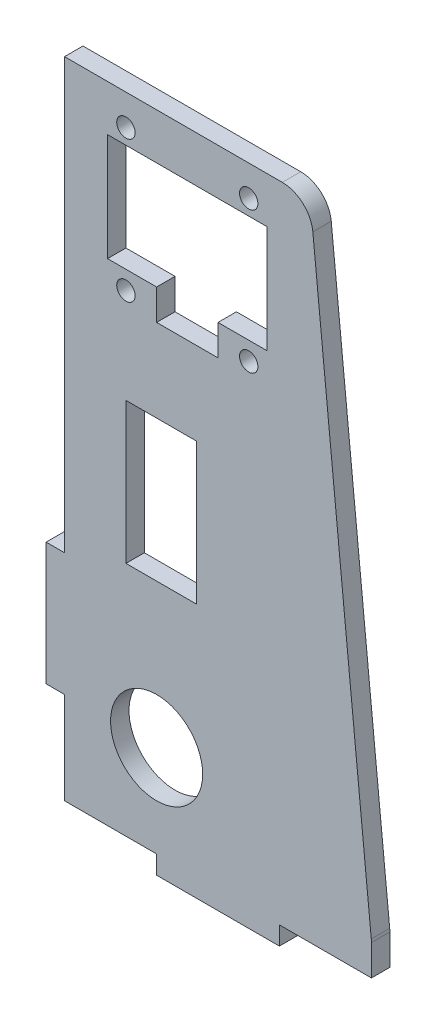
ISO-10303-21;
HEADER;
FILE_DESCRIPTION(('STEP AP214'),'2;1');
FILE_NAME('part.step','',(''),(''),'','','');
FILE_SCHEMA(('AUTOMOTIVE_DESIGN { 1 0 10303 214 1 1 1 1 }'));
ENDSEC;
DATA;
#1=APPLICATION_CONTEXT('core data for automotive mechanical design processes');
#2=APPLICATION_PROTOCOL_DEFINITION('international standard','automotive_design',2000,#1);
#3=PRODUCT_CONTEXT('',#1,'mechanical');
#4=PRODUCT('Part','Part','',(#3));
#5=PRODUCT_RELATED_PRODUCT_CATEGORY('part','',(#4));
#6=PRODUCT_DEFINITION_FORMATION('','',#4);
#7=PRODUCT_DEFINITION_CONTEXT('part definition',#1,'design');
#8=PRODUCT_DEFINITION('design','',#6,#7);
#9=PRODUCT_DEFINITION_SHAPE('','',#8);
#10=(LENGTH_UNIT() NAMED_UNIT(*) SI_UNIT(.MILLI.,.METRE.));
#11=(NAMED_UNIT(*) PLANE_ANGLE_UNIT() SI_UNIT($,.RADIAN.));
#12=(NAMED_UNIT(*) SI_UNIT($,.STERADIAN.) SOLID_ANGLE_UNIT());
#13=UNCERTAINTY_MEASURE_WITH_UNIT(LENGTH_MEASURE(1.E-05),#10,'distance_accuracy_value','');
#14=(GEOMETRIC_REPRESENTATION_CONTEXT(3) GLOBAL_UNCERTAINTY_ASSIGNED_CONTEXT((#13)) GLOBAL_UNIT_ASSIGNED_CONTEXT((#10,
#11,#12)) REPRESENTATION_CONTEXT('',''));
#15=CARTESIAN_POINT('',(0.,0.,0.));
#16=DIRECTION('',(0.,0.,1.));
#17=DIRECTION('',(1.,0.,0.));
#18=AXIS2_PLACEMENT_3D('',#15,#16,#17);
#19=CARTESIAN_POINT('',(35.4761904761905,100.,3.));
#20=DIRECTION('',(0.,0.,-1.));
#21=DIRECTION('',(-1.,0.,0.));
#22=AXIS2_PLACEMENT_3D('',#19,#20,#21);
#23=PLANE('',#22);
#24=DIRECTION('',(0.,-1.,0.));
#25=VECTOR('',#24,1.);
#26=CARTESIAN_POINT('',(10.,61.5,3.));
#27=LINE('',#26,#25);
#28=CARTESIAN_POINT('',(10.,61.5,3.));
#29=VERTEX_POINT('',#28);
#30=CARTESIAN_POINT('',(10.,38.5,3.));
#31=VERTEX_POINT('',#30);
#32=EDGE_CURVE('E280',#29,#31,#27,.T.);
#33=ORIENTED_EDGE('',*,*,#32,.F.);
#34=DIRECTION('',(-1.,0.,0.));
#35=VECTOR('',#34,1.);
#36=CARTESIAN_POINT('',(10.,61.5,3.));
#37=LINE('',#36,#35);
#38=CARTESIAN_POINT('',(21.5,61.5,3.));
#39=VERTEX_POINT('',#38);
#40=EDGE_CURVE('E288',#39,#29,#37,.T.);
#41=ORIENTED_EDGE('',*,*,#40,.F.);
#42=DIRECTION('',(0.,1.,0.));
#43=VECTOR('',#42,1.);
#44=CARTESIAN_POINT('',(21.5,61.5,3.));
#45=LINE('',#44,#43);
#46=CARTESIAN_POINT('',(21.5,38.5,3.));
#47=VERTEX_POINT('',#46);
#48=EDGE_CURVE('E285',#47,#39,#45,.T.);
#49=ORIENTED_EDGE('',*,*,#48,.F.);
#50=DIRECTION('',(1.,0.,0.));
#51=VECTOR('',#50,1.);
#52=CARTESIAN_POINT('',(10.,38.5,3.));
#53=LINE('',#52,#51);
#54=EDGE_CURVE('E282',#31,#47,#53,.T.);
#55=ORIENTED_EDGE('',*,*,#54,.F.);
#56=EDGE_LOOP('',(#33,#41,#49,#55));
#57=FACE_BOUND('',#56,.T.);
#58=DIRECTION('',(1.,0.,0.));
#59=VECTOR('',#58,1.);
#60=CARTESIAN_POINT('',(15.,0.,3.));
#61=LINE('',#60,#59);
#62=CARTESIAN_POINT('',(0.,0.,3.));
#63=VERTEX_POINT('',#62);
#64=CARTESIAN_POINT('',(15.,0.,3.));
#65=VERTEX_POINT('',#64);
#66=EDGE_CURVE('E311',#63,#65,#61,.T.);
#67=ORIENTED_EDGE('',*,*,#66,.T.);
#68=DIRECTION('',(0.,-1.,0.));
#69=VECTOR('',#68,1.);
#70=CARTESIAN_POINT('',(15.,0.,3.));
#71=LINE('',#70,#69);
#72=CARTESIAN_POINT('',(15.,-3.,3.));
#73=VERTEX_POINT('',#72);
#74=EDGE_CURVE('E314',#65,#73,#71,.T.);
#75=ORIENTED_EDGE('',*,*,#74,.T.);
#76=DIRECTION('',(1.,0.,0.));
#77=VECTOR('',#76,1.);
#78=CARTESIAN_POINT('',(15.,-3.,3.));
#79=LINE('',#78,#77);
#80=CARTESIAN_POINT('',(35.,-3.,3.));
#81=VERTEX_POINT('',#80);
#82=EDGE_CURVE('E317',#73,#81,#79,.T.);
#83=ORIENTED_EDGE('',*,*,#82,.T.);
#84=DIRECTION('',(0.,1.,0.));
#85=VECTOR('',#84,1.);
#86=CARTESIAN_POINT('',(35.,-3.,3.));
#87=LINE('',#86,#85);
#88=CARTESIAN_POINT('',(35.,0.,3.));
#89=VERTEX_POINT('',#88);
#90=EDGE_CURVE('E319',#81,#89,#87,.T.);
#91=ORIENTED_EDGE('',*,*,#90,.T.);
#92=DIRECTION('',(1.,0.,0.));
#93=VECTOR('',#92,1.);
#94=CARTESIAN_POINT('',(50.,0.,3.));
#95=LINE('',#94,#93);
#96=CARTESIAN_POINT('',(50.,0.,3.));
#97=VERTEX_POINT('',#96);
#98=EDGE_CURVE('E321',#89,#97,#95,.T.);
#99=ORIENTED_EDGE('',*,*,#98,.T.);
#100=DIRECTION('',(0.,1.,0.));
#101=VECTOR('',#100,1.);
#102=CARTESIAN_POINT('',(50.,5.,3.));
#103=LINE('',#102,#101);
#104=CARTESIAN_POINT('',(50.,5.,3.));
#105=VERTEX_POINT('',#104);
#106=EDGE_CURVE('E323',#97,#105,#103,.T.);
#107=ORIENTED_EDGE('',*,*,#106,.T.);
#108=CARTESIAN_POINT('',(45.,5.,3.));
#109=DIRECTION('',(0.,0.,1.));
#110=DIRECTION('',(-1.,0.,0.));
#111=AXIS2_PLACEMENT_3D('',#108,#109,#110);
#112=CIRCLE('',#111,5.);
#113=CARTESIAN_POINT('',(49.9750623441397,5.49875311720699,3.));
#114=VERTEX_POINT('',#113);
#115=EDGE_CURVE('E325',#105,#114,#112,.T.);
#116=ORIENTED_EDGE('',*,*,#115,.T.);
#117=DIRECTION('',(-0.0997506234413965,0.99501246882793,0.));
#118=VECTOR('',#117,1.);
#119=CARTESIAN_POINT('',(40.4512528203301,100.498753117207,3.));
#120=LINE('',#119,#118);
#121=CARTESIAN_POINT('',(40.4512528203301,100.498753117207,3.));
#122=VERTEX_POINT('',#121);
#123=EDGE_CURVE('E327',#114,#122,#120,.T.);
#124=ORIENTED_EDGE('',*,*,#123,.T.);
#125=CARTESIAN_POINT('',(35.4761904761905,100.,3.));
#126=DIRECTION('',(0.,0.,1.));
#127=DIRECTION('',(-1.,0.,0.));
#128=AXIS2_PLACEMENT_3D('',#125,#126,#127);
#129=CIRCLE('',#128,5.);
#130=CARTESIAN_POINT('',(35.4761904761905,105.,3.));
#131=VERTEX_POINT('',#130);
#132=EDGE_CURVE('E329',#122,#131,#129,.T.);
#133=ORIENTED_EDGE('',*,*,#132,.T.);
#134=DIRECTION('',(-1.,0.,0.));
#135=VECTOR('',#134,1.);
#136=CARTESIAN_POINT('',(0.,105.,3.));
#137=LINE('',#136,#135);
#138=CARTESIAN_POINT('',(0.,105.,3.));
#139=VERTEX_POINT('',#138);
#140=EDGE_CURVE('E331',#131,#139,#137,.T.);
#141=ORIENTED_EDGE('',*,*,#140,.T.);
#142=DIRECTION('',(0.,-1.,0.));
#143=VECTOR('',#142,1.);
#144=CARTESIAN_POINT('',(0.,35.,3.));
#145=LINE('',#144,#143);
#146=CARTESIAN_POINT('',(0.,35.,3.));
#147=VERTEX_POINT('',#146);
#148=EDGE_CURVE('E333',#139,#147,#145,.T.);
#149=ORIENTED_EDGE('',*,*,#148,.T.);
#150=DIRECTION('',(-1.,0.,0.));
#151=VECTOR('',#150,1.);
#152=CARTESIAN_POINT('',(-3.,35.,3.));
#153=LINE('',#152,#151);
#154=CARTESIAN_POINT('',(-3.,35.,3.));
#155=VERTEX_POINT('',#154);
#156=EDGE_CURVE('E335',#147,#155,#153,.T.);
#157=ORIENTED_EDGE('',*,*,#156,.T.);
#158=DIRECTION('',(0.,-1.,0.));
#159=VECTOR('',#158,1.);
#160=CARTESIAN_POINT('',(-3.,15.,3.));
#161=LINE('',#160,#159);
#162=CARTESIAN_POINT('',(-3.,15.,3.));
#163=VERTEX_POINT('',#162);
#164=EDGE_CURVE('E337',#155,#163,#161,.T.);
#165=ORIENTED_EDGE('',*,*,#164,.T.);
#166=DIRECTION('',(1.,0.,0.));
#167=VECTOR('',#166,1.);
#168=CARTESIAN_POINT('',(0.,15.,3.));
#169=LINE('',#168,#167);
#170=CARTESIAN_POINT('',(0.,15.,3.));
#171=VERTEX_POINT('',#170);
#172=EDGE_CURVE('E339',#163,#171,#169,.T.);
#173=ORIENTED_EDGE('',*,*,#172,.T.);
#174=DIRECTION('',(0.,-1.,0.));
#175=VECTOR('',#174,1.);
#176=CARTESIAN_POINT('',(0.,0.,3.));
#177=LINE('',#176,#175);
#178=EDGE_CURVE('E341',#171,#63,#177,.T.);
#179=ORIENTED_EDGE('',*,*,#178,.T.);
#180=EDGE_LOOP('',(#67,#75,#83,#91,#99,#107,#116,#124,#133,#141,#149,#157,#165,#173,#179));
#181=FACE_BOUND('',#180,.T.);
#182=DIRECTION('',(0.,-1.,0.));
#183=VECTOR('',#182,1.);
#184=CARTESIAN_POINT('',(7.,80.,3.));
#185=LINE('',#184,#183);
#186=CARTESIAN_POINT('',(7.,97.5,3.));
#187=VERTEX_POINT('',#186);
#188=CARTESIAN_POINT('',(7.,80.,3.));
#189=VERTEX_POINT('',#188);
#190=EDGE_CURVE('E212',#187,#189,#185,.T.);
#191=ORIENTED_EDGE('',*,*,#190,.F.);
#192=DIRECTION('',(-1.,0.,0.));
#193=VECTOR('',#192,1.);
#194=CARTESIAN_POINT('',(7.,97.5,3.));
#195=LINE('',#194,#193);
#196=CARTESIAN_POINT('',(33.,97.5,3.));
#197=VERTEX_POINT('',#196);
#198=EDGE_CURVE('E247',#197,#187,#195,.T.);
#199=ORIENTED_EDGE('',*,*,#198,.F.);
#200=DIRECTION('',(0.,1.,0.));
#201=VECTOR('',#200,1.);
#202=CARTESIAN_POINT('',(33.,97.5,3.));
#203=LINE('',#202,#201);
#204=CARTESIAN_POINT('',(33.,80.,3.));
#205=VERTEX_POINT('',#204);
#206=EDGE_CURVE('E245',#205,#197,#203,.T.);
#207=ORIENTED_EDGE('',*,*,#206,.F.);
#208=DIRECTION('',(1.,0.,0.));
#209=VECTOR('',#208,1.);
#210=CARTESIAN_POINT('',(33.,80.,3.));
#211=LINE('',#210,#209);
#212=CARTESIAN_POINT('',(25.,80.,3.));
#213=VERTEX_POINT('',#212);
#214=EDGE_CURVE('E243',#213,#205,#211,.T.);
#215=ORIENTED_EDGE('',*,*,#214,.F.);
#216=DIRECTION('',(0.,1.,0.));
#217=VECTOR('',#216,1.);
#218=CARTESIAN_POINT('',(25.,80.,3.));
#219=LINE('',#218,#217);
#220=CARTESIAN_POINT('',(25.,75.,3.));
#221=VERTEX_POINT('',#220);
#222=EDGE_CURVE('E241',#221,#213,#219,.T.);
#223=ORIENTED_EDGE('',*,*,#222,.F.);
#224=DIRECTION('',(1.,0.,0.));
#225=VECTOR('',#224,1.);
#226=CARTESIAN_POINT('',(25.,75.,3.));
#227=LINE('',#226,#225);
#228=CARTESIAN_POINT('',(15.,75.,3.));
#229=VERTEX_POINT('',#228);
#230=EDGE_CURVE('E236',#229,#221,#227,.T.);
#231=ORIENTED_EDGE('',*,*,#230,.F.);
#232=DIRECTION('',(0.,-1.,0.));
#233=VECTOR('',#232,1.);
#234=CARTESIAN_POINT('',(15.,75.,3.));
#235=LINE('',#234,#233);
#236=CARTESIAN_POINT('',(15.,80.,3.));
#237=VERTEX_POINT('',#236);
#238=EDGE_CURVE('E234',#237,#229,#235,.T.);
#239=ORIENTED_EDGE('',*,*,#238,.F.);
#240=DIRECTION('',(1.,0.,0.));
#241=VECTOR('',#240,1.);
#242=CARTESIAN_POINT('',(15.,80.,3.));
#243=LINE('',#242,#241);
#244=EDGE_CURVE('E220',#189,#237,#243,.T.);
#245=ORIENTED_EDGE('',*,*,#244,.F.);
#246=EDGE_LOOP('',(#191,#199,#207,#215,#223,#231,#239,#245));
#247=FACE_BOUND('',#246,.T.);
#248=CARTESIAN_POINT('',(10.,100.,3.));
#249=DIRECTION('',(0.,0.,1.));
#250=DIRECTION('',(1.,0.,0.));
#251=AXIS2_PLACEMENT_3D('',#248,#249,#250);
#252=CIRCLE('',#251,1.5);
#253=CARTESIAN_POINT('',(11.5,100.,3.));
#254=VERTEX_POINT('',#253);
#255=EDGE_CURVE('E250',#254,#254,#252,.T.);
#256=ORIENTED_EDGE('',*,*,#255,.F.);
#257=EDGE_LOOP('',(#256));
#258=FACE_BOUND('',#257,.T.);
#259=CARTESIAN_POINT('',(30.,100.,3.));
#260=DIRECTION('',(0.,0.,1.));
#261=DIRECTION('',(1.,0.,0.));
#262=AXIS2_PLACEMENT_3D('',#259,#260,#261);
#263=CIRCLE('',#262,1.5);
#264=CARTESIAN_POINT('',(31.5,100.,3.));
#265=VERTEX_POINT('',#264);
#266=EDGE_CURVE('E813',#265,#265,#263,.T.);
#267=ORIENTED_EDGE('',*,*,#266,.F.);
#268=EDGE_LOOP('',(#267));
#269=FACE_BOUND('',#268,.T.);
#270=CARTESIAN_POINT('',(10.,77.,3.));
#271=DIRECTION('',(0.,0.,1.));
#272=DIRECTION('',(1.,0.,0.));
#273=AXIS2_PLACEMENT_3D('',#270,#271,#272);
#274=CIRCLE('',#273,1.5);
#275=CARTESIAN_POINT('',(11.5,77.,3.));
#276=VERTEX_POINT('',#275);
#277=EDGE_CURVE('E807',#276,#276,#274,.T.);
#278=ORIENTED_EDGE('',*,*,#277,.F.);
#279=EDGE_LOOP('',(#278));
#280=FACE_BOUND('',#279,.T.);
#281=CARTESIAN_POINT('',(30.,77.,3.));
#282=DIRECTION('',(0.,0.,1.));
#283=DIRECTION('',(1.,0.,0.));
#284=AXIS2_PLACEMENT_3D('',#281,#282,#283);
#285=CIRCLE('',#284,1.5);
#286=CARTESIAN_POINT('',(31.5,77.,3.));
#287=VERTEX_POINT('',#286);
#288=EDGE_CURVE('E801',#287,#287,#285,.T.);
#289=ORIENTED_EDGE('',*,*,#288,.F.);
#290=EDGE_LOOP('',(#289));
#291=FACE_BOUND('',#290,.T.);
#292=CARTESIAN_POINT('',(15.,15.,3.));
#293=DIRECTION('',(0.,0.,1.));
#294=DIRECTION('',(1.,0.,0.));
#295=AXIS2_PLACEMENT_3D('',#292,#293,#294);
#296=CIRCLE('',#295,7.5);
#297=CARTESIAN_POINT('',(22.5,15.,3.));
#298=VERTEX_POINT('',#297);
#299=EDGE_CURVE('E792',#298,#298,#296,.T.);
#300=ORIENTED_EDGE('',*,*,#299,.F.);
#301=EDGE_LOOP('',(#300));
#302=FACE_BOUND('',#301,.T.);
#303=ADVANCED_FACE('F33',(#57,#181,#247,#258,#269,#280,#291,#302),#23,.F.);
#304=CARTESIAN_POINT('',(35.4761904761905,100.,0.));
#305=DIRECTION('',(0.,0.,-1.));
#306=DIRECTION('',(-1.,0.,0.));
#307=AXIS2_PLACEMENT_3D('',#304,#305,#306);
#308=PLANE('',#307);
#309=CARTESIAN_POINT('',(30.,77.,0.));
#310=DIRECTION('',(0.,0.,1.));
#311=DIRECTION('',(1.,0.,0.));
#312=AXIS2_PLACEMENT_3D('',#309,#310,#311);
#313=CIRCLE('',#312,1.5);
#314=CARTESIAN_POINT('',(31.5,77.,0.));
#315=VERTEX_POINT('',#314);
#316=EDGE_CURVE('E798',#315,#315,#313,.T.);
#317=ORIENTED_EDGE('',*,*,#316,.T.);
#318=EDGE_LOOP('',(#317));
#319=FACE_BOUND('',#318,.T.);
#320=CARTESIAN_POINT('',(30.,100.,0.));
#321=DIRECTION('',(0.,0.,1.));
#322=DIRECTION('',(1.,0.,0.));
#323=AXIS2_PLACEMENT_3D('',#320,#321,#322);
#324=CIRCLE('',#323,1.5);
#325=CARTESIAN_POINT('',(31.5,100.,0.));
#326=VERTEX_POINT('',#325);
#327=EDGE_CURVE('E810',#326,#326,#324,.T.);
#328=ORIENTED_EDGE('',*,*,#327,.T.);
#329=EDGE_LOOP('',(#328));
#330=FACE_BOUND('',#329,.T.);
#331=DIRECTION('',(-1.,0.,0.));
#332=VECTOR('',#331,1.);
#333=CARTESIAN_POINT('',(7.,97.5,0.));
#334=LINE('',#333,#332);
#335=CARTESIAN_POINT('',(33.,97.5,0.));
#336=VERTEX_POINT('',#335);
#337=CARTESIAN_POINT('',(7.,97.5,0.));
#338=VERTEX_POINT('',#337);
#339=EDGE_CURVE('E221',#336,#338,#334,.T.);
#340=ORIENTED_EDGE('',*,*,#339,.T.);
#341=DIRECTION('',(0.,-1.,0.));
#342=VECTOR('',#341,1.);
#343=CARTESIAN_POINT('',(7.,80.,0.));
#344=LINE('',#343,#342);
#345=CARTESIAN_POINT('',(7.,80.,0.));
#346=VERTEX_POINT('',#345);
#347=EDGE_CURVE('E56',#338,#346,#344,.T.);
#348=ORIENTED_EDGE('',*,*,#347,.T.);
#349=DIRECTION('',(1.,0.,0.));
#350=VECTOR('',#349,1.);
#351=CARTESIAN_POINT('',(15.,80.,0.));
#352=LINE('',#351,#350);
#353=CARTESIAN_POINT('',(15.,80.,0.));
#354=VERTEX_POINT('',#353);
#355=EDGE_CURVE('E227',#346,#354,#352,.T.);
#356=ORIENTED_EDGE('',*,*,#355,.T.);
#357=DIRECTION('',(0.,-1.,0.));
#358=VECTOR('',#357,1.);
#359=CARTESIAN_POINT('',(15.,75.,0.));
#360=LINE('',#359,#358);
#361=CARTESIAN_POINT('',(15.,75.,0.));
#362=VERTEX_POINT('',#361);
#363=EDGE_CURVE('E252',#354,#362,#360,.T.);
#364=ORIENTED_EDGE('',*,*,#363,.T.);
#365=DIRECTION('',(1.,0.,0.));
#366=VECTOR('',#365,1.);
#367=CARTESIAN_POINT('',(25.,75.,0.));
#368=LINE('',#367,#366);
#369=CARTESIAN_POINT('',(25.,75.,0.));
#370=VERTEX_POINT('',#369);
#371=EDGE_CURVE('E255',#362,#370,#368,.T.);
#372=ORIENTED_EDGE('',*,*,#371,.T.);
#373=DIRECTION('',(0.,1.,0.));
#374=VECTOR('',#373,1.);
#375=CARTESIAN_POINT('',(25.,80.,0.));
#376=LINE('',#375,#374);
#377=CARTESIAN_POINT('',(25.,80.,0.));
#378=VERTEX_POINT('',#377);
#379=EDGE_CURVE('E258',#370,#378,#376,.T.);
#380=ORIENTED_EDGE('',*,*,#379,.T.);
#381=DIRECTION('',(1.,0.,0.));
#382=VECTOR('',#381,1.);
#383=CARTESIAN_POINT('',(33.,80.,0.));
#384=LINE('',#383,#382);
#385=CARTESIAN_POINT('',(33.,80.,0.));
#386=VERTEX_POINT('',#385);
#387=EDGE_CURVE('E261',#378,#386,#384,.T.);
#388=ORIENTED_EDGE('',*,*,#387,.T.);
#389=DIRECTION('',(0.,1.,0.));
#390=VECTOR('',#389,1.);
#391=CARTESIAN_POINT('',(33.,97.5,0.));
#392=LINE('',#391,#390);
#393=EDGE_CURVE('E264',#386,#336,#392,.T.);
#394=ORIENTED_EDGE('',*,*,#393,.T.);
#395=EDGE_LOOP('',(#340,#348,#356,#364,#372,#380,#388,#394));
#396=FACE_BOUND('',#395,.T.);
#397=DIRECTION('',(-1.,0.,0.));
#398=VECTOR('',#397,1.);
#399=CARTESIAN_POINT('',(10.,61.5,0.));
#400=LINE('',#399,#398);
#401=CARTESIAN_POINT('',(21.5,61.5,0.));
#402=VERTEX_POINT('',#401);
#403=CARTESIAN_POINT('',(10.,61.5,0.));
#404=VERTEX_POINT('',#403);
#405=EDGE_CURVE('E283',#402,#404,#400,.T.);
#406=ORIENTED_EDGE('',*,*,#405,.T.);
#407=DIRECTION('',(0.,-1.,0.));
#408=VECTOR('',#407,1.);
#409=CARTESIAN_POINT('',(10.,61.5,0.));
#410=LINE('',#409,#408);
#411=CARTESIAN_POINT('',(10.,38.5,0.));
#412=VERTEX_POINT('',#411);
#413=EDGE_CURVE('E228',#404,#412,#410,.T.);
#414=ORIENTED_EDGE('',*,*,#413,.T.);
#415=DIRECTION('',(1.,0.,0.));
#416=VECTOR('',#415,1.);
#417=CARTESIAN_POINT('',(10.,38.5,0.));
#418=LINE('',#417,#416);
#419=CARTESIAN_POINT('',(21.5,38.5,0.));
#420=VERTEX_POINT('',#419);
#421=EDGE_CURVE('E293',#412,#420,#418,.T.);
#422=ORIENTED_EDGE('',*,*,#421,.T.);
#423=DIRECTION('',(0.,1.,0.));
#424=VECTOR('',#423,1.);
#425=CARTESIAN_POINT('',(21.5,61.5,0.));
#426=LINE('',#425,#424);
#427=EDGE_CURVE('E296',#420,#402,#426,.T.);
#428=ORIENTED_EDGE('',*,*,#427,.T.);
#429=EDGE_LOOP('',(#406,#414,#422,#428));
#430=FACE_BOUND('',#429,.T.);
#431=DIRECTION('',(1.,0.,0.));
#432=VECTOR('',#431,1.);
#433=CARTESIAN_POINT('',(15.,0.,0.));
#434=LINE('',#433,#432);
#435=CARTESIAN_POINT('',(0.,0.,0.));
#436=VERTEX_POINT('',#435);
#437=CARTESIAN_POINT('',(15.,0.,0.));
#438=VERTEX_POINT('',#437);
#439=EDGE_CURVE('E310',#436,#438,#434,.T.);
#440=ORIENTED_EDGE('',*,*,#439,.F.);
#441=DIRECTION('',(0.,-1.,0.));
#442=VECTOR('',#441,1.);
#443=CARTESIAN_POINT('',(0.,0.,0.));
#444=LINE('',#443,#442);
#445=CARTESIAN_POINT('',(0.,15.,0.));
#446=VERTEX_POINT('',#445);
#447=EDGE_CURVE('E315',#446,#436,#444,.T.);
#448=ORIENTED_EDGE('',*,*,#447,.F.);
#449=DIRECTION('',(1.,0.,0.));
#450=VECTOR('',#449,1.);
#451=CARTESIAN_POINT('',(0.,15.,0.));
#452=LINE('',#451,#450);
#453=CARTESIAN_POINT('',(-3.,15.,0.));
#454=VERTEX_POINT('',#453);
#455=EDGE_CURVE('E370',#454,#446,#452,.T.);
#456=ORIENTED_EDGE('',*,*,#455,.F.);
#457=DIRECTION('',(0.,-1.,0.));
#458=VECTOR('',#457,1.);
#459=CARTESIAN_POINT('',(-3.,15.,0.));
#460=LINE('',#459,#458);
#461=CARTESIAN_POINT('',(-3.,35.,0.));
#462=VERTEX_POINT('',#461);
#463=EDGE_CURVE('E368',#462,#454,#460,.T.);
#464=ORIENTED_EDGE('',*,*,#463,.F.);
#465=DIRECTION('',(-1.,0.,0.));
#466=VECTOR('',#465,1.);
#467=CARTESIAN_POINT('',(-3.,35.,0.));
#468=LINE('',#467,#466);
#469=CARTESIAN_POINT('',(0.,35.,0.));
#470=VERTEX_POINT('',#469);
#471=EDGE_CURVE('E366',#470,#462,#468,.T.);
#472=ORIENTED_EDGE('',*,*,#471,.F.);
#473=DIRECTION('',(0.,-1.,0.));
#474=VECTOR('',#473,1.);
#475=CARTESIAN_POINT('',(0.,35.,0.));
#476=LINE('',#475,#474);
#477=CARTESIAN_POINT('',(0.,105.,0.));
#478=VERTEX_POINT('',#477);
#479=EDGE_CURVE('E364',#478,#470,#476,.T.);
#480=ORIENTED_EDGE('',*,*,#479,.F.);
#481=DIRECTION('',(-1.,0.,0.));
#482=VECTOR('',#481,1.);
#483=CARTESIAN_POINT('',(0.,105.,0.));
#484=LINE('',#483,#482);
#485=CARTESIAN_POINT('',(35.4761904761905,105.,0.));
#486=VERTEX_POINT('',#485);
#487=EDGE_CURVE('E362',#486,#478,#484,.T.);
#488=ORIENTED_EDGE('',*,*,#487,.F.);
#489=CARTESIAN_POINT('',(35.4761904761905,100.,0.));
#490=DIRECTION('',(0.,0.,1.));
#491=DIRECTION('',(-1.,0.,0.));
#492=AXIS2_PLACEMENT_3D('',#489,#490,#491);
#493=CIRCLE('',#492,5.);
#494=CARTESIAN_POINT('',(40.4512528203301,100.498753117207,0.));
#495=VERTEX_POINT('',#494);
#496=EDGE_CURVE('E360',#495,#486,#493,.T.);
#497=ORIENTED_EDGE('',*,*,#496,.F.);
#498=DIRECTION('',(-0.0997506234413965,0.99501246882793,0.));
#499=VECTOR('',#498,1.);
#500=CARTESIAN_POINT('',(40.4512528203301,100.498753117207,0.));
#501=LINE('',#500,#499);
#502=CARTESIAN_POINT('',(49.9750623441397,5.49875311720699,0.));
#503=VERTEX_POINT('',#502);
#504=EDGE_CURVE('E358',#503,#495,#501,.T.);
#505=ORIENTED_EDGE('',*,*,#504,.F.);
#506=CARTESIAN_POINT('',(45.,5.,0.));
#507=DIRECTION('',(0.,0.,1.));
#508=DIRECTION('',(-1.,0.,0.));
#509=AXIS2_PLACEMENT_3D('',#506,#507,#508);
#510=CIRCLE('',#509,5.);
#511=CARTESIAN_POINT('',(50.,5.,0.));
#512=VERTEX_POINT('',#511);
#513=EDGE_CURVE('E356',#512,#503,#510,.T.);
#514=ORIENTED_EDGE('',*,*,#513,.F.);
#515=DIRECTION('',(0.,1.,0.));
#516=VECTOR('',#515,1.);
#517=CARTESIAN_POINT('',(50.,5.,0.));
#518=LINE('',#517,#516);
#519=CARTESIAN_POINT('',(50.,0.,0.));
#520=VERTEX_POINT('',#519);
#521=EDGE_CURVE('E354',#520,#512,#518,.T.);
#522=ORIENTED_EDGE('',*,*,#521,.F.);
#523=DIRECTION('',(1.,0.,0.));
#524=VECTOR('',#523,1.);
#525=CARTESIAN_POINT('',(50.,0.,0.));
#526=LINE('',#525,#524);
#527=CARTESIAN_POINT('',(35.,0.,0.));
#528=VERTEX_POINT('',#527);
#529=EDGE_CURVE('E352',#528,#520,#526,.T.);
#530=ORIENTED_EDGE('',*,*,#529,.F.);
#531=DIRECTION('',(0.,1.,0.));
#532=VECTOR('',#531,1.);
#533=CARTESIAN_POINT('',(35.,-3.,0.));
#534=LINE('',#533,#532);
#535=CARTESIAN_POINT('',(35.,-3.,0.));
#536=VERTEX_POINT('',#535);
#537=EDGE_CURVE('E350',#536,#528,#534,.T.);
#538=ORIENTED_EDGE('',*,*,#537,.F.);
#539=DIRECTION('',(1.,0.,0.));
#540=VECTOR('',#539,1.);
#541=CARTESIAN_POINT('',(15.,-3.,0.));
#542=LINE('',#541,#540);
#543=CARTESIAN_POINT('',(15.,-3.,0.));
#544=VERTEX_POINT('',#543);
#545=EDGE_CURVE('E348',#544,#536,#542,.T.);
#546=ORIENTED_EDGE('',*,*,#545,.F.);
#547=DIRECTION('',(0.,-1.,0.));
#548=VECTOR('',#547,1.);
#549=CARTESIAN_POINT('',(15.,0.,0.));
#550=LINE('',#549,#548);
#551=EDGE_CURVE('E346',#438,#544,#550,.T.);
#552=ORIENTED_EDGE('',*,*,#551,.F.);
#553=EDGE_LOOP('',(#440,#448,#456,#464,#472,#480,#488,#497,#505,#514,#522,#530,#538,#546,#552));
#554=FACE_BOUND('',#553,.T.);
#555=CARTESIAN_POINT('',(10.,100.,0.));
#556=DIRECTION('',(0.,0.,1.));
#557=DIRECTION('',(1.,0.,0.));
#558=AXIS2_PLACEMENT_3D('',#555,#556,#557);
#559=CIRCLE('',#558,1.5);
#560=CARTESIAN_POINT('',(11.5,100.,0.));
#561=VERTEX_POINT('',#560);
#562=EDGE_CURVE('E816',#561,#561,#559,.T.);
#563=ORIENTED_EDGE('',*,*,#562,.T.);
#564=EDGE_LOOP('',(#563));
#565=FACE_BOUND('',#564,.T.);
#566=CARTESIAN_POINT('',(10.,77.,0.));
#567=DIRECTION('',(0.,0.,1.));
#568=DIRECTION('',(1.,0.,0.));
#569=AXIS2_PLACEMENT_3D('',#566,#567,#568);
#570=CIRCLE('',#569,1.5);
#571=CARTESIAN_POINT('',(11.5,77.,0.));
#572=VERTEX_POINT('',#571);
#573=EDGE_CURVE('E804',#572,#572,#570,.T.);
#574=ORIENTED_EDGE('',*,*,#573,.T.);
#575=EDGE_LOOP('',(#574));
#576=FACE_BOUND('',#575,.T.);
#577=CARTESIAN_POINT('',(15.,15.,0.));
#578=DIRECTION('',(0.,0.,1.));
#579=DIRECTION('',(1.,0.,0.));
#580=AXIS2_PLACEMENT_3D('',#577,#578,#579);
#581=CIRCLE('',#580,7.5);
#582=CARTESIAN_POINT('',(22.5,15.,0.));
#583=VERTEX_POINT('',#582);
#584=EDGE_CURVE('E795',#583,#583,#581,.T.);
#585=ORIENTED_EDGE('',*,*,#584,.T.);
#586=EDGE_LOOP('',(#585));
#587=FACE_BOUND('',#586,.T.);
#588=ADVANCED_FACE('F421',(#319,#330,#396,#430,#554,#565,#576,#587),#308,.T.);
#589=CARTESIAN_POINT('',(15.,0.,3.));
#590=DIRECTION('',(0.,1.,0.));
#591=DIRECTION('',(-1.,0.,0.));
#592=AXIS2_PLACEMENT_3D('',#589,#590,#591);
#593=PLANE('',#592);
#594=ORIENTED_EDGE('',*,*,#439,.T.);
#595=DIRECTION('',(0.,0.,-1.));
#596=VECTOR('',#595,1.);
#597=CARTESIAN_POINT('',(15.,0.,3.));
#598=LINE('',#597,#596);
#599=EDGE_CURVE('E11',#65,#438,#598,.T.);
#600=ORIENTED_EDGE('',*,*,#599,.F.);
#601=ORIENTED_EDGE('',*,*,#66,.F.);
#602=DIRECTION('',(0.,0.,-1.));
#603=VECTOR('',#602,1.);
#604=CARTESIAN_POINT('',(0.,0.,3.));
#605=LINE('',#604,#603);
#606=EDGE_CURVE('E343',#63,#436,#605,.T.);
#607=ORIENTED_EDGE('',*,*,#606,.T.);
#608=EDGE_LOOP('',(#594,#600,#601,#607));
#609=FACE_BOUND('',#608,.T.);
#610=ADVANCED_FACE('F35',(#609),#593,.F.);
#611=CARTESIAN_POINT('',(15.,0.,3.));
#612=DIRECTION('',(1.,0.,0.));
#613=DIRECTION('',(0.,0.,-1.));
#614=AXIS2_PLACEMENT_3D('',#611,#612,#613);
#615=PLANE('',#614);
#616=ORIENTED_EDGE('',*,*,#551,.T.);
#617=DIRECTION('',(0.,0.,-1.));
#618=VECTOR('',#617,1.);
#619=CARTESIAN_POINT('',(15.,-3.,3.));
#620=LINE('',#619,#618);
#621=EDGE_CURVE('E41',#73,#544,#620,.T.);
#622=ORIENTED_EDGE('',*,*,#621,.F.);
#623=ORIENTED_EDGE('',*,*,#74,.F.);
#624=ORIENTED_EDGE('',*,*,#599,.T.);
#625=EDGE_LOOP('',(#616,#622,#623,#624));
#626=FACE_BOUND('',#625,.T.);
#627=ADVANCED_FACE('F438',(#626),#615,.F.);
#628=CARTESIAN_POINT('',(15.,-3.,3.));
#629=DIRECTION('',(0.,1.,0.));
#630=DIRECTION('',(0.,0.,1.));
#631=AXIS2_PLACEMENT_3D('',#628,#629,#630);
#632=PLANE('',#631);
#633=ORIENTED_EDGE('',*,*,#545,.T.);
#634=DIRECTION('',(0.,0.,-1.));
#635=VECTOR('',#634,1.);
#636=CARTESIAN_POINT('',(35.,-3.,3.));
#637=LINE('',#636,#635);
#638=EDGE_CURVE('E408',#81,#536,#637,.T.);
#639=ORIENTED_EDGE('',*,*,#638,.F.);
#640=ORIENTED_EDGE('',*,*,#82,.F.);
#641=ORIENTED_EDGE('',*,*,#621,.T.);
#642=EDGE_LOOP('',(#633,#639,#640,#641));
#643=FACE_BOUND('',#642,.T.);
#644=ADVANCED_FACE('F415',(#643),#632,.F.);
#645=CARTESIAN_POINT('',(35.,-3.,3.));
#646=DIRECTION('',(-1.,0.,0.));
#647=DIRECTION('',(0.,0.,1.));
#648=AXIS2_PLACEMENT_3D('',#645,#646,#647);
#649=PLANE('',#648);
#650=ORIENTED_EDGE('',*,*,#537,.T.);
#651=DIRECTION('',(0.,0.,-1.));
#652=VECTOR('',#651,1.);
#653=CARTESIAN_POINT('',(35.,0.,3.));
#654=LINE('',#653,#652);
#655=EDGE_CURVE('E405',#89,#528,#654,.T.);
#656=ORIENTED_EDGE('',*,*,#655,.F.);
#657=ORIENTED_EDGE('',*,*,#90,.F.);
#658=ORIENTED_EDGE('',*,*,#638,.T.);
#659=EDGE_LOOP('',(#650,#656,#657,#658));
#660=FACE_BOUND('',#659,.T.);
#661=ADVANCED_FACE('F427',(#660),#649,.F.);
#662=CARTESIAN_POINT('',(50.,0.,3.));
#663=DIRECTION('',(0.,1.,0.));
#664=DIRECTION('',(-1.,0.,0.));
#665=AXIS2_PLACEMENT_3D('',#662,#663,#664);
#666=PLANE('',#665);
#667=ORIENTED_EDGE('',*,*,#529,.T.);
#668=DIRECTION('',(0.,0.,-1.));
#669=VECTOR('',#668,1.);
#670=CARTESIAN_POINT('',(50.,0.,3.));
#671=LINE('',#670,#669);
#672=EDGE_CURVE('E402',#97,#520,#671,.T.);
#673=ORIENTED_EDGE('',*,*,#672,.F.);
#674=ORIENTED_EDGE('',*,*,#98,.F.);
#675=ORIENTED_EDGE('',*,*,#655,.T.);
#676=EDGE_LOOP('',(#667,#673,#674,#675));
#677=FACE_BOUND('',#676,.T.);
#678=ADVANCED_FACE('F431',(#677),#666,.F.);
#679=CARTESIAN_POINT('',(50.,5.,3.));
#680=DIRECTION('',(-1.,0.,0.));
#681=DIRECTION('',(0.,0.,1.));
#682=AXIS2_PLACEMENT_3D('',#679,#680,#681);
#683=PLANE('',#682);
#684=ORIENTED_EDGE('',*,*,#521,.T.);
#685=DIRECTION('',(0.,0.,-1.));
#686=VECTOR('',#685,1.);
#687=CARTESIAN_POINT('',(50.,5.,3.));
#688=LINE('',#687,#686);
#689=EDGE_CURVE('E399',#105,#512,#688,.T.);
#690=ORIENTED_EDGE('',*,*,#689,.F.);
#691=ORIENTED_EDGE('',*,*,#106,.F.);
#692=ORIENTED_EDGE('',*,*,#672,.T.);
#693=EDGE_LOOP('',(#684,#690,#691,#692));
#694=FACE_BOUND('',#693,.T.);
#695=ADVANCED_FACE('F486',(#694),#683,.F.);
#696=CARTESIAN_POINT('',(45.,5.,3.));
#697=DIRECTION('',(0.,0.,-1.));
#698=DIRECTION('',(-1.,0.,0.));
#699=AXIS2_PLACEMENT_3D('',#696,#697,#698);
#700=CYLINDRICAL_SURFACE('',#699,5.);
#701=ORIENTED_EDGE('',*,*,#513,.T.);
#702=DIRECTION('',(0.,0.,-1.));
#703=VECTOR('',#702,1.);
#704=CARTESIAN_POINT('',(49.9750623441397,5.49875311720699,3.));
#705=LINE('',#704,#703);
#706=EDGE_CURVE('E396',#114,#503,#705,.T.);
#707=ORIENTED_EDGE('',*,*,#706,.F.);
#708=ORIENTED_EDGE('',*,*,#115,.F.);
#709=ORIENTED_EDGE('',*,*,#689,.T.);
#710=EDGE_LOOP('',(#701,#707,#708,#709));
#711=FACE_BOUND('',#710,.T.);
#712=ADVANCED_FACE('F484',(#711),#700,.T.);
#713=CARTESIAN_POINT('',(40.4512528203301,100.498753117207,3.));
#714=DIRECTION('',(-0.99501246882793,-0.0997506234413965,0.));
#715=DIRECTION('',(0.0997506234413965,-0.99501246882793,0.));
#716=AXIS2_PLACEMENT_3D('',#713,#714,#715);
#717=PLANE('',#716);
#718=ORIENTED_EDGE('',*,*,#504,.T.);
#719=DIRECTION('',(0.,0.,-1.));
#720=VECTOR('',#719,1.);
#721=CARTESIAN_POINT('',(40.4512528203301,100.498753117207,3.));
#722=LINE('',#721,#720);
#723=EDGE_CURVE('E393',#122,#495,#722,.T.);
#724=ORIENTED_EDGE('',*,*,#723,.F.);
#725=ORIENTED_EDGE('',*,*,#123,.F.);
#726=ORIENTED_EDGE('',*,*,#706,.T.);
#727=EDGE_LOOP('',(#718,#724,#725,#726));
#728=FACE_BOUND('',#727,.T.);
#729=ADVANCED_FACE('F480',(#728),#717,.F.);
#730=CARTESIAN_POINT('',(35.4761904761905,100.,3.));
#731=DIRECTION('',(0.,0.,-1.));
#732=DIRECTION('',(-1.,0.,0.));
#733=AXIS2_PLACEMENT_3D('',#730,#731,#732);
#734=CYLINDRICAL_SURFACE('',#733,5.);
#735=ORIENTED_EDGE('',*,*,#496,.T.);
#736=DIRECTION('',(0.,0.,-1.));
#737=VECTOR('',#736,1.);
#738=CARTESIAN_POINT('',(35.4761904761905,105.,3.));
#739=LINE('',#738,#737);
#740=EDGE_CURVE('E390',#131,#486,#739,.T.);
#741=ORIENTED_EDGE('',*,*,#740,.F.);
#742=ORIENTED_EDGE('',*,*,#132,.F.);
#743=ORIENTED_EDGE('',*,*,#723,.T.);
#744=EDGE_LOOP('',(#735,#741,#742,#743));
#745=FACE_BOUND('',#744,.T.);
#746=ADVANCED_FACE('F475',(#745),#734,.T.);
#747=CARTESIAN_POINT('',(0.,105.,3.));
#748=DIRECTION('',(0.,-1.,0.));
#749=DIRECTION('',(0.,0.,-1.));
#750=AXIS2_PLACEMENT_3D('',#747,#748,#749);
#751=PLANE('',#750);
#752=ORIENTED_EDGE('',*,*,#487,.T.);
#753=DIRECTION('',(0.,0.,-1.));
#754=VECTOR('',#753,1.);
#755=CARTESIAN_POINT('',(0.,105.,3.));
#756=LINE('',#755,#754);
#757=EDGE_CURVE('E387',#139,#478,#756,.T.);
#758=ORIENTED_EDGE('',*,*,#757,.F.);
#759=ORIENTED_EDGE('',*,*,#140,.F.);
#760=ORIENTED_EDGE('',*,*,#740,.T.);
#761=EDGE_LOOP('',(#752,#758,#759,#760));
#762=FACE_BOUND('',#761,.T.);
#763=ADVANCED_FACE('F469',(#762),#751,.F.);
#764=CARTESIAN_POINT('',(0.,35.,3.));
#765=DIRECTION('',(1.,0.,0.));
#766=DIRECTION('',(0.,0.,-1.));
#767=AXIS2_PLACEMENT_3D('',#764,#765,#766);
#768=PLANE('',#767);
#769=ORIENTED_EDGE('',*,*,#479,.T.);
#770=DIRECTION('',(0.,0.,-1.));
#771=VECTOR('',#770,1.);
#772=CARTESIAN_POINT('',(0.,35.,3.));
#773=LINE('',#772,#771);
#774=EDGE_CURVE('E384',#147,#470,#773,.T.);
#775=ORIENTED_EDGE('',*,*,#774,.F.);
#776=ORIENTED_EDGE('',*,*,#148,.F.);
#777=ORIENTED_EDGE('',*,*,#757,.T.);
#778=EDGE_LOOP('',(#769,#775,#776,#777));
#779=FACE_BOUND('',#778,.T.);
#780=ADVANCED_FACE('F465',(#779),#768,.F.);
#781=CARTESIAN_POINT('',(-3.,35.,3.));
#782=DIRECTION('',(0.,-1.,0.));
#783=DIRECTION('',(1.,0.,0.));
#784=AXIS2_PLACEMENT_3D('',#781,#782,#783);
#785=PLANE('',#784);
#786=ORIENTED_EDGE('',*,*,#471,.T.);
#787=DIRECTION('',(0.,0.,-1.));
#788=VECTOR('',#787,1.);
#789=CARTESIAN_POINT('',(-3.,35.,3.));
#790=LINE('',#789,#788);
#791=EDGE_CURVE('E381',#155,#462,#790,.T.);
#792=ORIENTED_EDGE('',*,*,#791,.F.);
#793=ORIENTED_EDGE('',*,*,#156,.F.);
#794=ORIENTED_EDGE('',*,*,#774,.T.);
#795=EDGE_LOOP('',(#786,#792,#793,#794));
#796=FACE_BOUND('',#795,.T.);
#797=ADVANCED_FACE('F460',(#796),#785,.F.);
#798=CARTESIAN_POINT('',(-3.,15.,3.));
#799=DIRECTION('',(1.,0.,0.));
#800=DIRECTION('',(0.,0.,-1.));
#801=AXIS2_PLACEMENT_3D('',#798,#799,#800);
#802=PLANE('',#801);
#803=ORIENTED_EDGE('',*,*,#463,.T.);
#804=DIRECTION('',(0.,0.,-1.));
#805=VECTOR('',#804,1.);
#806=CARTESIAN_POINT('',(-3.,15.,3.));
#807=LINE('',#806,#805);
#808=EDGE_CURVE('E378',#163,#454,#807,.T.);
#809=ORIENTED_EDGE('',*,*,#808,.F.);
#810=ORIENTED_EDGE('',*,*,#164,.F.);
#811=ORIENTED_EDGE('',*,*,#791,.T.);
#812=EDGE_LOOP('',(#803,#809,#810,#811));
#813=FACE_BOUND('',#812,.T.);
#814=ADVANCED_FACE('F454',(#813),#802,.F.);
#815=CARTESIAN_POINT('',(0.,15.,3.));
#816=DIRECTION('',(0.,1.,0.));
#817=DIRECTION('',(0.,0.,1.));
#818=AXIS2_PLACEMENT_3D('',#815,#816,#817);
#819=PLANE('',#818);
#820=ORIENTED_EDGE('',*,*,#455,.T.);
#821=DIRECTION('',(0.,0.,-1.));
#822=VECTOR('',#821,1.);
#823=CARTESIAN_POINT('',(0.,15.,3.));
#824=LINE('',#823,#822);
#825=EDGE_CURVE('E375',#171,#446,#824,.T.);
#826=ORIENTED_EDGE('',*,*,#825,.F.);
#827=ORIENTED_EDGE('',*,*,#172,.F.);
#828=ORIENTED_EDGE('',*,*,#808,.T.);
#829=EDGE_LOOP('',(#820,#826,#827,#828));
#830=FACE_BOUND('',#829,.T.);
#831=ADVANCED_FACE('F450',(#830),#819,.F.);
#832=CARTESIAN_POINT('',(0.,0.,3.));
#833=DIRECTION('',(1.,0.,0.));
#834=DIRECTION('',(0.,0.,-1.));
#835=AXIS2_PLACEMENT_3D('',#832,#833,#834);
#836=PLANE('',#835);
#837=ORIENTED_EDGE('',*,*,#447,.T.);
#838=ORIENTED_EDGE('',*,*,#606,.F.);
#839=ORIENTED_EDGE('',*,*,#178,.F.);
#840=ORIENTED_EDGE('',*,*,#825,.T.);
#841=EDGE_LOOP('',(#837,#838,#839,#840));
#842=FACE_BOUND('',#841,.T.);
#843=ADVANCED_FACE('F445',(#842),#836,.F.);
#844=CARTESIAN_POINT('',(10.,61.5,3.));
#845=DIRECTION('',(1.,0.,0.));
#846=DIRECTION('',(0.,1.,0.));
#847=AXIS2_PLACEMENT_3D('',#844,#845,#846);
#848=PLANE('',#847);
#849=ORIENTED_EDGE('',*,*,#413,.F.);
#850=DIRECTION('',(0.,0.,-1.));
#851=VECTOR('',#850,1.);
#852=CARTESIAN_POINT('',(10.,61.5,3.));
#853=LINE('',#852,#851);
#854=EDGE_CURVE('E290',#29,#404,#853,.T.);
#855=ORIENTED_EDGE('',*,*,#854,.F.);
#856=ORIENTED_EDGE('',*,*,#32,.T.);
#857=DIRECTION('',(0.,0.,-1.));
#858=VECTOR('',#857,1.);
#859=CARTESIAN_POINT('',(10.,38.5,3.));
#860=LINE('',#859,#858);
#861=EDGE_CURVE('E307',#31,#412,#860,.T.);
#862=ORIENTED_EDGE('',*,*,#861,.T.);
#863=EDGE_LOOP('',(#849,#855,#856,#862));
#864=FACE_BOUND('',#863,.T.);
#865=ADVANCED_FACE('F505',(#864),#848,.T.);
#866=CARTESIAN_POINT('',(10.,38.5,3.));
#867=DIRECTION('',(0.,1.,0.));
#868=DIRECTION('',(0.,0.,1.));
#869=AXIS2_PLACEMENT_3D('',#866,#867,#868);
#870=PLANE('',#869);
#871=ORIENTED_EDGE('',*,*,#421,.F.);
#872=ORIENTED_EDGE('',*,*,#861,.F.);
#873=ORIENTED_EDGE('',*,*,#54,.T.);
#874=DIRECTION('',(0.,0.,-1.));
#875=VECTOR('',#874,1.);
#876=CARTESIAN_POINT('',(21.5,38.5,3.));
#877=LINE('',#876,#875);
#878=EDGE_CURVE('E305',#47,#420,#877,.T.);
#879=ORIENTED_EDGE('',*,*,#878,.T.);
#880=EDGE_LOOP('',(#871,#872,#873,#879));
#881=FACE_BOUND('',#880,.T.);
#882=ADVANCED_FACE('F561',(#881),#870,.T.);
#883=CARTESIAN_POINT('',(21.5,61.5,3.));
#884=DIRECTION('',(-1.,0.,0.));
#885=DIRECTION('',(0.,-1.,0.));
#886=AXIS2_PLACEMENT_3D('',#883,#884,#885);
#887=PLANE('',#886);
#888=ORIENTED_EDGE('',*,*,#427,.F.);
#889=ORIENTED_EDGE('',*,*,#878,.F.);
#890=ORIENTED_EDGE('',*,*,#48,.T.);
#891=DIRECTION('',(0.,0.,-1.));
#892=VECTOR('',#891,1.);
#893=CARTESIAN_POINT('',(21.5,61.5,3.));
#894=LINE('',#893,#892);
#895=EDGE_CURVE('E303',#39,#402,#894,.T.);
#896=ORIENTED_EDGE('',*,*,#895,.T.);
#897=EDGE_LOOP('',(#888,#889,#890,#896));
#898=FACE_BOUND('',#897,.T.);
#899=ADVANCED_FACE('F568',(#898),#887,.T.);
#900=CARTESIAN_POINT('',(10.,61.5,3.));
#901=DIRECTION('',(0.,-1.,0.));
#902=DIRECTION('',(1.,0.,0.));
#903=AXIS2_PLACEMENT_3D('',#900,#901,#902);
#904=PLANE('',#903);
#905=ORIENTED_EDGE('',*,*,#405,.F.);
#906=ORIENTED_EDGE('',*,*,#895,.F.);
#907=ORIENTED_EDGE('',*,*,#40,.T.);
#908=ORIENTED_EDGE('',*,*,#854,.T.);
#909=EDGE_LOOP('',(#905,#906,#907,#908));
#910=FACE_BOUND('',#909,.T.);
#911=ADVANCED_FACE('F575',(#910),#904,.T.);
#912=CARTESIAN_POINT('',(7.,80.,3.));
#913=DIRECTION('',(1.,0.,0.));
#914=DIRECTION('',(0.,0.,-1.));
#915=AXIS2_PLACEMENT_3D('',#912,#913,#914);
#916=PLANE('',#915);
#917=ORIENTED_EDGE('',*,*,#347,.F.);
#918=DIRECTION('',(0.,0.,-1.));
#919=VECTOR('',#918,1.);
#920=CARTESIAN_POINT('',(7.,97.5,3.));
#921=LINE('',#920,#919);
#922=EDGE_CURVE('E216',#187,#338,#921,.T.);
#923=ORIENTED_EDGE('',*,*,#922,.F.);
#924=ORIENTED_EDGE('',*,*,#190,.T.);
#925=DIRECTION('',(0.,0.,-1.));
#926=VECTOR('',#925,1.);
#927=CARTESIAN_POINT('',(7.,80.,3.));
#928=LINE('',#927,#926);
#929=EDGE_CURVE('E215',#189,#346,#928,.T.);
#930=ORIENTED_EDGE('',*,*,#929,.T.);
#931=EDGE_LOOP('',(#917,#923,#924,#930));
#932=FACE_BOUND('',#931,.T.);
#933=ADVANCED_FACE('F214',(#932),#916,.T.);
#934=CARTESIAN_POINT('',(15.,80.,3.));
#935=DIRECTION('',(0.,1.,0.));
#936=DIRECTION('',(0.,0.,1.));
#937=AXIS2_PLACEMENT_3D('',#934,#935,#936);
#938=PLANE('',#937);
#939=ORIENTED_EDGE('',*,*,#355,.F.);
#940=ORIENTED_EDGE('',*,*,#929,.F.);
#941=ORIENTED_EDGE('',*,*,#244,.T.);
#942=DIRECTION('',(0.,0.,-1.));
#943=VECTOR('',#942,1.);
#944=CARTESIAN_POINT('',(15.,80.,3.));
#945=LINE('',#944,#943);
#946=EDGE_CURVE('E229',#237,#354,#945,.T.);
#947=ORIENTED_EDGE('',*,*,#946,.T.);
#948=EDGE_LOOP('',(#939,#940,#941,#947));
#949=FACE_BOUND('',#948,.T.);
#950=ADVANCED_FACE('F224',(#949),#938,.T.);
#951=CARTESIAN_POINT('',(15.,75.,3.));
#952=DIRECTION('',(1.,0.,0.));
#953=DIRECTION('',(0.,0.,-1.));
#954=AXIS2_PLACEMENT_3D('',#951,#952,#953);
#955=PLANE('',#954);
#956=ORIENTED_EDGE('',*,*,#363,.F.);
#957=ORIENTED_EDGE('',*,*,#946,.F.);
#958=ORIENTED_EDGE('',*,*,#238,.T.);
#959=DIRECTION('',(0.,0.,-1.));
#960=VECTOR('',#959,1.);
#961=CARTESIAN_POINT('',(15.,75.,3.));
#962=LINE('',#961,#960);
#963=EDGE_CURVE('E277',#229,#362,#962,.T.);
#964=ORIENTED_EDGE('',*,*,#963,.T.);
#965=EDGE_LOOP('',(#956,#957,#958,#964));
#966=FACE_BOUND('',#965,.T.);
#967=ADVANCED_FACE('F596',(#966),#955,.T.);
#968=CARTESIAN_POINT('',(25.,75.,3.));
#969=DIRECTION('',(0.,1.,0.));
#970=DIRECTION('',(0.,0.,1.));
#971=AXIS2_PLACEMENT_3D('',#968,#969,#970);
#972=PLANE('',#971);
#973=ORIENTED_EDGE('',*,*,#371,.F.);
#974=ORIENTED_EDGE('',*,*,#963,.F.);
#975=ORIENTED_EDGE('',*,*,#230,.T.);
#976=DIRECTION('',(0.,0.,-1.));
#977=VECTOR('',#976,1.);
#978=CARTESIAN_POINT('',(25.,75.,3.));
#979=LINE('',#978,#977);
#980=EDGE_CURVE('E275',#221,#370,#979,.T.);
#981=ORIENTED_EDGE('',*,*,#980,.T.);
#982=EDGE_LOOP('',(#973,#974,#975,#981));
#983=FACE_BOUND('',#982,.T.);
#984=ADVANCED_FACE('F603',(#983),#972,.T.);
#985=CARTESIAN_POINT('',(25.,80.,3.));
#986=DIRECTION('',(-1.,0.,0.));
#987=DIRECTION('',(0.,0.,1.));
#988=AXIS2_PLACEMENT_3D('',#985,#986,#987);
#989=PLANE('',#988);
#990=ORIENTED_EDGE('',*,*,#379,.F.);
#991=ORIENTED_EDGE('',*,*,#980,.F.);
#992=ORIENTED_EDGE('',*,*,#222,.T.);
#993=DIRECTION('',(0.,0.,-1.));
#994=VECTOR('',#993,1.);
#995=CARTESIAN_POINT('',(25.,80.,3.));
#996=LINE('',#995,#994);
#997=EDGE_CURVE('E273',#213,#378,#996,.T.);
#998=ORIENTED_EDGE('',*,*,#997,.T.);
#999=EDGE_LOOP('',(#990,#991,#992,#998));
#1000=FACE_BOUND('',#999,.T.);
#1001=ADVANCED_FACE('F611',(#1000),#989,.T.);
#1002=CARTESIAN_POINT('',(33.,80.,3.));
#1003=DIRECTION('',(0.,1.,0.));
#1004=DIRECTION('',(-1.,0.,0.));
#1005=AXIS2_PLACEMENT_3D('',#1002,#1003,#1004);
#1006=PLANE('',#1005);
#1007=ORIENTED_EDGE('',*,*,#387,.F.);
#1008=ORIENTED_EDGE('',*,*,#997,.F.);
#1009=ORIENTED_EDGE('',*,*,#214,.T.);
#1010=DIRECTION('',(0.,0.,-1.));
#1011=VECTOR('',#1010,1.);
#1012=CARTESIAN_POINT('',(33.,80.,3.));
#1013=LINE('',#1012,#1011);
#1014=EDGE_CURVE('E271',#205,#386,#1013,.T.);
#1015=ORIENTED_EDGE('',*,*,#1014,.T.);
#1016=EDGE_LOOP('',(#1007,#1008,#1009,#1015));
#1017=FACE_BOUND('',#1016,.T.);
#1018=ADVANCED_FACE('F619',(#1017),#1006,.T.);
#1019=CARTESIAN_POINT('',(33.,97.5,3.));
#1020=DIRECTION('',(-1.,0.,0.));
#1021=DIRECTION('',(0.,0.,1.));
#1022=AXIS2_PLACEMENT_3D('',#1019,#1020,#1021);
#1023=PLANE('',#1022);
#1024=ORIENTED_EDGE('',*,*,#393,.F.);
#1025=ORIENTED_EDGE('',*,*,#1014,.F.);
#1026=ORIENTED_EDGE('',*,*,#206,.T.);
#1027=DIRECTION('',(0.,0.,-1.));
#1028=VECTOR('',#1027,1.);
#1029=CARTESIAN_POINT('',(33.,97.5,3.));
#1030=LINE('',#1029,#1028);
#1031=EDGE_CURVE('E48',#197,#336,#1030,.T.);
#1032=ORIENTED_EDGE('',*,*,#1031,.T.);
#1033=EDGE_LOOP('',(#1024,#1025,#1026,#1032));
#1034=FACE_BOUND('',#1033,.T.);
#1035=ADVANCED_FACE('F627',(#1034),#1023,.T.);
#1036=CARTESIAN_POINT('',(7.,97.5,3.));
#1037=DIRECTION('',(0.,-1.,0.));
#1038=DIRECTION('',(0.,0.,-1.));
#1039=AXIS2_PLACEMENT_3D('',#1036,#1037,#1038);
#1040=PLANE('',#1039);
#1041=ORIENTED_EDGE('',*,*,#339,.F.);
#1042=ORIENTED_EDGE('',*,*,#1031,.F.);
#1043=ORIENTED_EDGE('',*,*,#198,.T.);
#1044=ORIENTED_EDGE('',*,*,#922,.T.);
#1045=EDGE_LOOP('',(#1041,#1042,#1043,#1044));
#1046=FACE_BOUND('',#1045,.T.);
#1047=ADVANCED_FACE('F635',(#1046),#1040,.T.);
#1048=CARTESIAN_POINT('',(10.,100.,3.));
#1049=DIRECTION('',(0.,0.,-1.));
#1050=DIRECTION('',(-1.,0.,0.));
#1051=AXIS2_PLACEMENT_3D('',#1048,#1049,#1050);
#1052=CYLINDRICAL_SURFACE('',#1051,1.5);
#1053=ORIENTED_EDGE('',*,*,#255,.T.);
#1054=EDGE_LOOP('',(#1053));
#1055=FACE_BOUND('',#1054,.T.);
#1056=ORIENTED_EDGE('',*,*,#562,.F.);
#1057=EDGE_LOOP('',(#1056));
#1058=FACE_BOUND('',#1057,.T.);
#1059=ADVANCED_FACE('F643',(#1055,#1058),#1052,.F.);
#1060=CARTESIAN_POINT('',(30.,100.,3.));
#1061=DIRECTION('',(0.,0.,-1.));
#1062=DIRECTION('',(-1.,0.,0.));
#1063=AXIS2_PLACEMENT_3D('',#1060,#1061,#1062);
#1064=CYLINDRICAL_SURFACE('',#1063,1.5);
#1065=ORIENTED_EDGE('',*,*,#266,.T.);
#1066=EDGE_LOOP('',(#1065));
#1067=FACE_BOUND('',#1066,.T.);
#1068=ORIENTED_EDGE('',*,*,#327,.F.);
#1069=EDGE_LOOP('',(#1068));
#1070=FACE_BOUND('',#1069,.T.);
#1071=ADVANCED_FACE('F650',(#1067,#1070),#1064,.F.);
#1072=CARTESIAN_POINT('',(10.,77.,3.));
#1073=DIRECTION('',(0.,0.,-1.));
#1074=DIRECTION('',(-1.,0.,0.));
#1075=AXIS2_PLACEMENT_3D('',#1072,#1073,#1074);
#1076=CYLINDRICAL_SURFACE('',#1075,1.5);
#1077=ORIENTED_EDGE('',*,*,#277,.T.);
#1078=EDGE_LOOP('',(#1077));
#1079=FACE_BOUND('',#1078,.T.);
#1080=ORIENTED_EDGE('',*,*,#573,.F.);
#1081=EDGE_LOOP('',(#1080));
#1082=FACE_BOUND('',#1081,.T.);
#1083=ADVANCED_FACE('F658',(#1079,#1082),#1076,.F.);
#1084=CARTESIAN_POINT('',(30.,77.,3.));
#1085=DIRECTION('',(0.,0.,-1.));
#1086=DIRECTION('',(-1.,0.,0.));
#1087=AXIS2_PLACEMENT_3D('',#1084,#1085,#1086);
#1088=CYLINDRICAL_SURFACE('',#1087,1.5);
#1089=ORIENTED_EDGE('',*,*,#288,.T.);
#1090=EDGE_LOOP('',(#1089));
#1091=FACE_BOUND('',#1090,.T.);
#1092=ORIENTED_EDGE('',*,*,#316,.F.);
#1093=EDGE_LOOP('',(#1092));
#1094=FACE_BOUND('',#1093,.T.);
#1095=ADVANCED_FACE('F666',(#1091,#1094),#1088,.F.);
#1096=CARTESIAN_POINT('',(15.,15.,3.));
#1097=DIRECTION('',(0.,0.,-1.));
#1098=DIRECTION('',(-1.,0.,0.));
#1099=AXIS2_PLACEMENT_3D('',#1096,#1097,#1098);
#1100=CYLINDRICAL_SURFACE('',#1099,7.5);
#1101=ORIENTED_EDGE('',*,*,#299,.T.);
#1102=EDGE_LOOP('',(#1101));
#1103=FACE_BOUND('',#1102,.T.);
#1104=ORIENTED_EDGE('',*,*,#584,.F.);
#1105=EDGE_LOOP('',(#1104));
#1106=FACE_BOUND('',#1105,.T.);
#1107=ADVANCED_FACE('F674',(#1103,#1106),#1100,.F.);
#1108=CLOSED_SHELL('',(#303,#588,#610,#627,#644,#661,#678,#695,#712,#729,#746,#763,#780,#797,
#814,#831,#843,#865,#882,#899,#911,#933,#950,#967,#984,#1001,#1018,#1035,#1047,#1059,#1071,
#1083,#1095,#1107));
#1109=MANIFOLD_SOLID_BREP('B2',#1108);
#1110=ADVANCED_BREP_SHAPE_REPRESENTATION('',(#18,#1109),#14);
#1111=SHAPE_DEFINITION_REPRESENTATION(#9,#1110);
ENDSEC;
END-ISO-10303-21;
